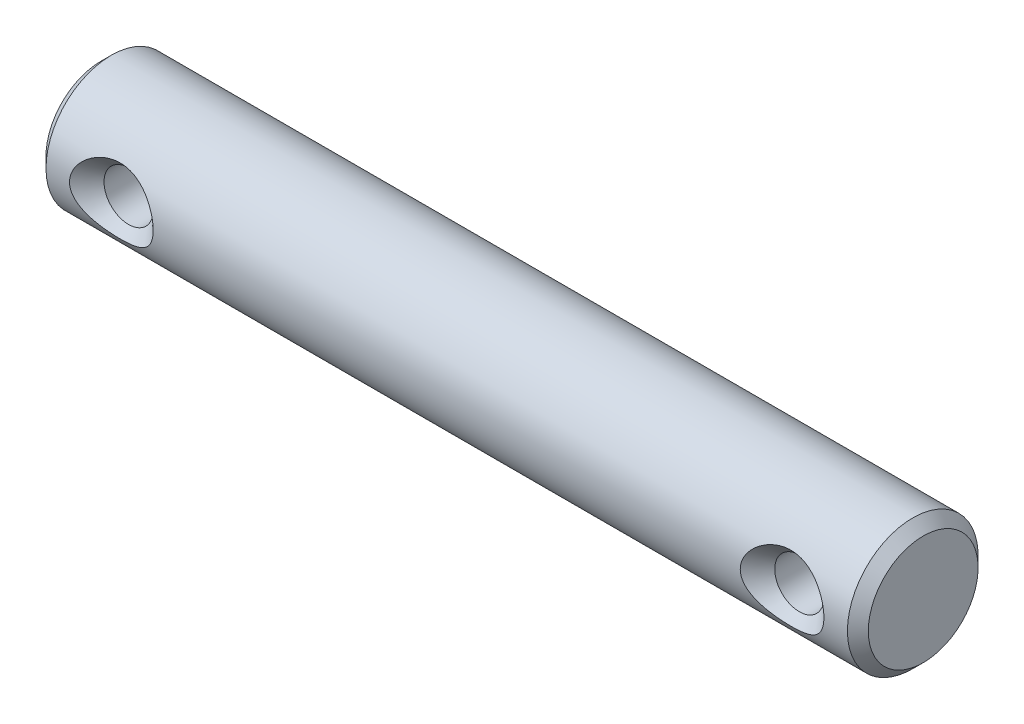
ISO-10303-21;
HEADER;
FILE_DESCRIPTION(('STEP AP214'),'2;1');
FILE_NAME('part.step','',(''),(''),'','','');
FILE_SCHEMA(('AUTOMOTIVE_DESIGN { 1 0 10303 214 1 1 1 1 }'));
ENDSEC;
DATA;
#1=APPLICATION_CONTEXT('core data for automotive mechanical design processes');
#2=APPLICATION_PROTOCOL_DEFINITION('international standard','automotive_design',2000,#1);
#3=PRODUCT_CONTEXT('',#1,'mechanical');
#4=PRODUCT('Part','Part','',(#3));
#5=PRODUCT_RELATED_PRODUCT_CATEGORY('part','',(#4));
#6=PRODUCT_DEFINITION_FORMATION('','',#4);
#7=PRODUCT_DEFINITION_CONTEXT('part definition',#1,'design');
#8=PRODUCT_DEFINITION('design','',#6,#7);
#9=PRODUCT_DEFINITION_SHAPE('','',#8);
#10=(LENGTH_UNIT() NAMED_UNIT(*) SI_UNIT(.MILLI.,.METRE.));
#11=(NAMED_UNIT(*) PLANE_ANGLE_UNIT() SI_UNIT($,.RADIAN.));
#12=(NAMED_UNIT(*) SI_UNIT($,.STERADIAN.) SOLID_ANGLE_UNIT());
#13=UNCERTAINTY_MEASURE_WITH_UNIT(LENGTH_MEASURE(1.E-05),#10,'distance_accuracy_value','');
#14=(GEOMETRIC_REPRESENTATION_CONTEXT(3) GLOBAL_UNCERTAINTY_ASSIGNED_CONTEXT((#13)) GLOBAL_UNIT_ASSIGNED_CONTEXT((#10,
#11,#12)) REPRESENTATION_CONTEXT('',''));
#15=CARTESIAN_POINT('',(0.,0.,0.));
#16=DIRECTION('',(0.,0.,1.));
#17=DIRECTION('',(1.,0.,0.));
#18=AXIS2_PLACEMENT_3D('',#15,#16,#17);
#19=CARTESIAN_POINT('',(14.5542,-2.667,2.72034000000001));
#20=DIRECTION('',(1.,0.,0.));
#21=DIRECTION('',(0.,0.,-1.));
#22=AXIS2_PLACEMENT_3D('',#19,#20,#21);
#23=PLANE('',#22);
#24=CARTESIAN_POINT('',(14.5542,0.,0.));
#25=DIRECTION('',(-1.,0.,0.));
#26=DIRECTION('',(0.,0.,1.));
#27=AXIS2_PLACEMENT_3D('',#24,#25,#26);
#28=CIRCLE('',#27,2.667);
#29=CARTESIAN_POINT('',(14.5542,0.,2.667));
#30=VERTEX_POINT('',#29);
#31=EDGE_CURVE('E35',#30,#30,#28,.T.);
#32=ORIENTED_EDGE('',*,*,#31,.F.);
#33=EDGE_LOOP('',(#32));
#34=FACE_BOUND('',#33,.T.);
#35=ADVANCED_FACE('F30',(#34),#23,.T.);
#36=CARTESIAN_POINT('',(-25.4,-2.66700000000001,-2.72033999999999));
#37=DIRECTION('',(-1.,0.,0.));
#38=DIRECTION('',(0.,0.,1.));
#39=AXIS2_PLACEMENT_3D('',#36,#37,#38);
#40=PLANE('',#39);
#41=CARTESIAN_POINT('',(-25.4,0.,0.));
#42=DIRECTION('',(1.,0.,0.));
#43=DIRECTION('',(0.,1.,0.));
#44=AXIS2_PLACEMENT_3D('',#41,#42,#43);
#45=CIRCLE('',#44,2.667);
#46=CARTESIAN_POINT('',(-25.4,2.667,0.));
#47=VERTEX_POINT('',#46);
#48=EDGE_CURVE('E57',#47,#47,#45,.T.);
#49=ORIENTED_EDGE('',*,*,#48,.F.);
#50=EDGE_LOOP('',(#49));
#51=FACE_BOUND('',#50,.T.);
#52=ADVANCED_FACE('F91',(#51),#40,.T.);
#53=CARTESIAN_POINT('',(-21.717,0.,2.3368));
#54=DIRECTION('',(0.,0.,1.));
#55=DIRECTION('',(1.,0.,0.));
#56=AXIS2_PLACEMENT_3D('',#53,#54,#55);
#57=CONICAL_SURFACE('',#56,1.19380000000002,0.78539816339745);
#58=CARTESIAN_POINT('',(-21.717,0.,2.3368));
#59=DIRECTION('',(0.,0.,1.));
#60=DIRECTION('',(1.,0.,0.));
#61=AXIS2_PLACEMENT_3D('',#58,#59,#60);
#62=CIRCLE('',#61,1.19380000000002);
#63=CARTESIAN_POINT('',(-20.5232,0.,2.3368));
#64=VERTEX_POINT('',#63);
#65=EDGE_CURVE('E55',#64,#64,#62,.T.);
#66=ORIENTED_EDGE('',*,*,#65,.F.);
#67=EDGE_LOOP('',(#66));
#68=FACE_BOUND('',#67,.T.);
#69=CARTESIAN_POINT('',(-23.749,0.,3.17499999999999));
#70=CARTESIAN_POINT('',(-23.7490015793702,-0.069534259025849,3.17500076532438));
#71=CARTESIAN_POINT('',(-23.7431066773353,-0.139062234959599,3.17269326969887));
#72=CARTESIAN_POINT('',(-23.7200005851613,-0.275943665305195,3.16373080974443));
#73=CARTESIAN_POINT('',(-23.7027806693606,-0.34329540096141,3.15707249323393));
#74=CARTESIAN_POINT('',(-23.6583668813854,-0.47367804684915,3.14015343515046));
#75=CARTESIAN_POINT('',(-23.631225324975,-0.536729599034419,3.12991160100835));
#76=CARTESIAN_POINT('',(-23.5684843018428,-0.657809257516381,3.1067202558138));
#77=CARTESIAN_POINT('',(-23.5328940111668,-0.715842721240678,3.09377368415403));
#78=CARTESIAN_POINT('',(-23.4746909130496,-0.798182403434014,3.0731597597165));
#79=CARTESIAN_POINT('',(-23.454720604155,-0.824590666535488,3.06616876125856));
#80=CARTESIAN_POINT('',(-23.375823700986,-0.922539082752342,3.03894032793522));
#81=CARTESIAN_POINT('',(-23.3115905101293,-0.989585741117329,3.01755028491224));
#82=CARTESIAN_POINT('',(-23.1737834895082,-1.11317376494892,2.97418590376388));
#83=CARTESIAN_POINT('',(-23.1001877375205,-1.16968968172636,2.95221029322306));
#84=CARTESIAN_POINT('',(-22.9719311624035,-1.25489334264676,2.91671264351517));
#85=CARTESIAN_POINT('',(-22.9192918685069,-1.28652579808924,2.90284671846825));
#86=CARTESIAN_POINT('',(-22.8113504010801,-1.34523649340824,2.87610883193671));
#87=CARTESIAN_POINT('',(-22.756049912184,-1.37231756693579,2.86323625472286));
#88=CARTESIAN_POINT('',(-22.5856781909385,-1.4472443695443,2.82652533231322));
#89=CARTESIAN_POINT('',(-22.4670097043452,-1.4882027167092,2.80484671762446));
#90=CARTESIAN_POINT('',(-22.2234022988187,-1.55153991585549,2.77031828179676));
#91=CARTESIAN_POINT('',(-22.0984528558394,-1.57388640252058,2.75748384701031));
#92=CARTESIAN_POINT('',(-21.8465418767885,-1.59945402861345,2.7427352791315));
#93=CARTESIAN_POINT('',(-21.719592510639,-1.60276428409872,2.74077026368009));
#94=CARTESIAN_POINT('',(-21.4671146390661,-1.59040531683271,2.74796072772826));
#95=CARTESIAN_POINT('',(-21.3415842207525,-1.57476579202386,2.75709880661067));
#96=CARTESIAN_POINT('',(-21.1358617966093,-1.53309932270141,2.78039060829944));
#97=CARTESIAN_POINT('',(-21.0542901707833,-1.51215437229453,2.79192016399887));
#98=CARTESIAN_POINT('',(-20.8942291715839,-1.4619552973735,2.81853183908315));
#99=CARTESIAN_POINT('',(-20.8157436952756,-1.43269102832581,2.83361829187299));
#100=CARTESIAN_POINT('',(-20.6292008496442,-1.35118727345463,2.87364039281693));
#101=CARTESIAN_POINT('',(-20.5233540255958,-1.29450619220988,2.89998656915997));
#102=CARTESIAN_POINT('',(-20.3236711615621,-1.16392124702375,2.95480929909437));
#103=CARTESIAN_POINT('',(-20.2298012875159,-1.0900676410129,2.98327947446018));
#104=CARTESIAN_POINT('',(-20.1186561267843,-0.982990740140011,3.01910959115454));
#105=CARTESIAN_POINT('',(-20.0938731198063,-0.957642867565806,3.02725793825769));
#106=CARTESIAN_POINT('',(-20.0458915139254,-0.905383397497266,3.04329666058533));
#107=CARTESIAN_POINT('',(-20.0226938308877,-0.878470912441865,3.05118688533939));
#108=CARTESIAN_POINT('',(-19.9512023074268,-0.789772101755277,3.07585625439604));
#109=CARTESIAN_POINT('',(-19.9062814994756,-0.724972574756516,3.0919126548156));
#110=CARTESIAN_POINT('',(-19.8271540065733,-0.588351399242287,3.12079047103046));
#111=CARTESIAN_POINT('',(-19.7929522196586,-0.516526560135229,3.13361040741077));
#112=CARTESIAN_POINT('',(-19.7392936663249,-0.371692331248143,3.15396370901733));
#113=CARTESIAN_POINT('',(-19.719084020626,-0.299004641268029,3.16176505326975));
#114=CARTESIAN_POINT('',(-19.6919478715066,-0.150870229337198,3.17227888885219));
#115=CARTESIAN_POINT('',(-19.6850035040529,-0.0754273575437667,3.17499822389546));
#116=CARTESIAN_POINT('',(-19.684996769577,0.0695372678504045,3.17500163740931));
#117=CARTESIAN_POINT('',(-19.6908927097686,0.139061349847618,3.17269357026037));
#118=CARTESIAN_POINT('',(-19.7139993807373,0.275940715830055,3.16373076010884));
#119=CARTESIAN_POINT('',(-19.731219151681,0.343294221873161,3.15707254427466));
#120=CARTESIAN_POINT('',(-19.775633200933,0.473678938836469,3.14015342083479));
#121=CARTESIAN_POINT('',(-19.8027751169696,0.536730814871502,3.12991143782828));
#122=CARTESIAN_POINT('',(-19.8655164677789,0.657810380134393,3.1067199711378));
#123=CARTESIAN_POINT('',(-19.9011065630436,0.715843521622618,3.09377347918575));
#124=CARTESIAN_POINT('',(-19.9590282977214,0.797785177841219,3.07325920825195));
#125=CARTESIAN_POINT('',(-19.9786934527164,0.823815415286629,3.06637390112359));
#126=CARTESIAN_POINT('',(-20.05721158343,0.921473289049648,3.03926521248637));
#127=CARTESIAN_POINT('',(-20.1214039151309,0.988588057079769,3.01787861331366));
#128=CARTESIAN_POINT('',(-20.2591439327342,1.11230673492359,2.97451165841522));
#129=CARTESIAN_POINT('',(-20.3327135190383,1.16888525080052,2.9525300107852));
#130=CARTESIAN_POINT('',(-20.4606192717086,1.25397837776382,2.91710375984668));
#131=CARTESIAN_POINT('',(-20.51291151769,1.28546745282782,2.90331405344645));
#132=CARTESIAN_POINT('',(-20.6201341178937,1.34394625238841,2.87671047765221));
#133=CARTESIAN_POINT('',(-20.6750628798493,1.37093864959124,2.86389603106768));
#134=CARTESIAN_POINT('',(-20.8449813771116,1.44598740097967,2.82717234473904));
#135=CARTESIAN_POINT('',(-20.9635964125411,1.48712709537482,2.8054198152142));
#136=CARTESIAN_POINT('',(-21.2071033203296,1.55081946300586,2.77072408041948));
#137=CARTESIAN_POINT('',(-21.3320046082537,1.57334331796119,2.75779453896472));
#138=CARTESIAN_POINT('',(-21.5838242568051,1.59926255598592,2.74284832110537));
#139=CARTESIAN_POINT('',(-21.7107293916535,1.60275312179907,2.74077734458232));
#140=CARTESIAN_POINT('',(-21.9632422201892,1.59076921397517,2.74774842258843));
#141=CARTESIAN_POINT('',(-22.0888506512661,1.57530619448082,2.75678376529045));
#142=CARTESIAN_POINT('',(-22.3323543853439,1.52634209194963,2.78417996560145));
#143=CARTESIAN_POINT('',(-22.4503607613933,1.49326521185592,2.80232096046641));
#144=CARTESIAN_POINT('',(-22.6789323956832,1.40959996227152,2.84532224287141));
#145=CARTESIAN_POINT('',(-22.7894846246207,1.35898183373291,2.87019393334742));
#146=CARTESIAN_POINT('',(-23.003066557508,1.23844305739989,2.92427659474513));
#147=CARTESIAN_POINT('',(-23.1057675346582,1.16798481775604,2.95359607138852));
#148=CARTESIAN_POINT('',(-23.2952388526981,1.00813226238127,3.01188921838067));
#149=CARTESIAN_POINT('',(-23.3820609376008,0.918801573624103,3.04086371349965));
#150=CARTESIAN_POINT('',(-23.5035326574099,0.760390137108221,3.0832225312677));
#151=CARTESIAN_POINT('',(-23.5452713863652,0.697164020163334,3.09825643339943));
#152=CARTESIAN_POINT('',(-23.6185593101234,0.564423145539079,3.1251588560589));
#153=CARTESIAN_POINT('',(-23.6501211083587,0.494916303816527,3.13703128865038));
#154=CARTESIAN_POINT('',(-23.6994017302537,0.355475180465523,3.1557706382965));
#155=CARTESIAN_POINT('',(-23.7178687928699,0.285845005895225,3.16290627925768));
#156=CARTESIAN_POINT('',(-23.7426629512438,0.144139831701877,3.17251896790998));
#157=CARTESIAN_POINT('',(-23.7489983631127,0.0720665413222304,3.17499920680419));
#158=CARTESIAN_POINT('',(-23.749,0.,3.17499999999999));
#159=B_SPLINE_CURVE_WITH_KNOTS('',3,(#69,#70,#71,#72,#73,#74,#75,#76,#77,#78,#79,#80,#81,#82,
#83,#84,#85,#86,#87,#88,#89,#90,#91,#92,#93,#94,#95,#96,#97,#98,#99,#100,#101,#102,#103,#104,
#105,#106,#107,#108,#109,#110,#111,#112,#113,#114,#115,#116,#117,#118,#119,#120,#121,#122,#123,
#124,#125,#126,#127,#128,#129,#130,#131,#132,#133,#134,#135,#136,#137,#138,#139,#140,#141,#142,
#143,#144,#145,#146,#147,#148,#149,#150,#151,#152,#153,#154,#155,#156,#157,#158),.UNSPECIFIED.,
.T.,.F.,(4,2,2,2,2,2,2,2,2,2,2,2,2,2,2,2,2,2,2,2,2,2,2,2,2,2,2,2,2,2,2,2,2,2,2,2,2,2,2,2,2,2,2,
2,4),(0.,0.208318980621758,0.41679865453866,0.624194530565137,0.831366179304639,
0.932844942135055,1.21732651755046,1.50248690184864,1.69113678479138,1.87966877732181,
2.25991242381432,2.64081592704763,3.01993481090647,3.39846031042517,3.65296959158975,
3.90779056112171,4.27490923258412,4.6409667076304,4.75003704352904,4.859169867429,
5.09956038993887,5.34006059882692,5.56632681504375,5.79228810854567,6.00060418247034,
6.20908676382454,6.4164846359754,6.62365428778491,6.72364453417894,7.00818115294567,
7.29339491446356,7.4809120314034,7.66831729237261,8.04862132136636,8.42951298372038,
8.80849810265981,9.18725430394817,9.55727593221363,9.9279284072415,10.3097933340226,
10.6903908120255,10.9212930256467,11.1519081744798,11.3679618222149,11.5838673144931),.UNSPECIFIED.);
#160=CARTESIAN_POINT('',(-23.749,0.,3.17499999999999));
#161=VERTEX_POINT('',#160);
#162=EDGE_CURVE('E51',#161,#161,#159,.T.);
#163=ORIENTED_EDGE('',*,*,#162,.T.);
#164=EDGE_LOOP('',(#163));
#165=FACE_BOUND('',#164,.T.);
#166=ADVANCED_FACE('F85',(#68,#165),#57,.F.);
#167=CARTESIAN_POINT('',(14.5542,0.,0.));
#168=DIRECTION('',(-1.,0.,0.));
#169=DIRECTION('',(0.,0.,1.));
#170=AXIS2_PLACEMENT_3D('',#167,#168,#169);
#171=CONICAL_SURFACE('',#170,2.667,0.785398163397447);
#172=CARTESIAN_POINT('',(14.0462,0.,0.));
#173=DIRECTION('',(-1.,0.,0.));
#174=DIRECTION('',(0.,0.,1.));
#175=AXIS2_PLACEMENT_3D('',#172,#173,#174);
#176=CIRCLE('',#175,3.175);
#177=CARTESIAN_POINT('',(14.0462,0.,3.175));
#178=VERTEX_POINT('',#177);
#179=EDGE_CURVE('E47',#178,#178,#176,.T.);
#180=ORIENTED_EDGE('',*,*,#179,.F.);
#181=EDGE_LOOP('',(#180));
#182=FACE_BOUND('',#181,.T.);
#183=ORIENTED_EDGE('',*,*,#31,.T.);
#184=EDGE_LOOP('',(#183));
#185=FACE_BOUND('',#184,.T.);
#186=ADVANCED_FACE('F90',(#182,#185),#171,.T.);
#187=CARTESIAN_POINT('',(-24.892,0.,0.));
#188=DIRECTION('',(1.,0.,0.));
#189=DIRECTION('',(0.,1.,0.));
#190=AXIS2_PLACEMENT_3D('',#187,#188,#189);
#191=CONICAL_SURFACE('',#190,3.175,0.78539816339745);
#192=ORIENTED_EDGE('',*,*,#48,.T.);
#193=EDGE_LOOP('',(#192));
#194=FACE_BOUND('',#193,.T.);
#195=CARTESIAN_POINT('',(-24.892,0.,0.));
#196=DIRECTION('',(1.,0.,0.));
#197=DIRECTION('',(0.,1.,0.));
#198=AXIS2_PLACEMENT_3D('',#195,#196,#197);
#199=CIRCLE('',#198,3.175);
#200=CARTESIAN_POINT('',(-24.892,3.17500000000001,0.));
#201=VERTEX_POINT('',#200);
#202=EDGE_CURVE('E50',#201,#201,#199,.T.);
#203=ORIENTED_EDGE('',*,*,#202,.F.);
#204=EDGE_LOOP('',(#203));
#205=FACE_BOUND('',#204,.T.);
#206=ADVANCED_FACE('F95',(#194,#205),#191,.T.);
#207=CARTESIAN_POINT('',(-21.717,0.,-3.17783227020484));
#208=DIRECTION('',(0.,0.,1.));
#209=DIRECTION('',(1.,0.,0.));
#210=AXIS2_PLACEMENT_3D('',#207,#208,#209);
#211=CYLINDRICAL_SURFACE('',#210,1.19380000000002);
#212=ORIENTED_EDGE('',*,*,#65,.T.);
#213=EDGE_LOOP('',(#212));
#214=FACE_BOUND('',#213,.T.);
#215=CARTESIAN_POINT('',(-22.9108,0.,-3.175));
#216=CARTESIAN_POINT('',(-22.9107980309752,-0.0646395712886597,-3.17499825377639));
#217=CARTESIAN_POINT('',(-22.9055305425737,-0.129305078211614,-3.17300734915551));
#218=CARTESIAN_POINT('',(-22.8846618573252,-0.256688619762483,-3.16525020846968));
#219=CARTESIAN_POINT('',(-22.869063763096,-0.319407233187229,-3.15948510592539));
#220=CARTESIAN_POINT('',(-22.8356793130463,-0.418772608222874,-3.14750197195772));
#221=CARTESIAN_POINT('',(-22.8207965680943,-0.456540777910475,-3.14222653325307));
#222=CARTESIAN_POINT('',(-22.7873447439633,-0.530243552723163,-3.13063219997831));
#223=CARTESIAN_POINT('',(-22.7687751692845,-0.566177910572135,-3.12431316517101));
#224=CARTESIAN_POINT('',(-22.7141070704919,-0.659990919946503,-3.10622496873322));
#225=CARTESIAN_POINT('',(-22.6747645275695,-0.715868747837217,-3.09370774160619));
#226=CARTESIAN_POINT('',(-22.5872866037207,-0.819990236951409,-3.06775614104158));
#227=CARTESIAN_POINT('',(-22.5391521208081,-0.868234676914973,-3.05432186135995));
#228=CARTESIAN_POINT('',(-22.4608319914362,-0.934383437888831,-3.03448483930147));
#229=CARTESIAN_POINT('',(-22.4334137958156,-0.955567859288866,-3.0278633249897));
#230=CARTESIAN_POINT('',(-22.3767925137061,-0.995506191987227,-3.01496796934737));
#231=CARTESIAN_POINT('',(-22.3475898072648,-1.01426061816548,-3.00869405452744));
#232=CARTESIAN_POINT('',(-22.2626724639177,-1.06368648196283,-2.9917120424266));
#233=CARTESIAN_POINT('',(-22.2050375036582,-1.09135814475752,-2.98163663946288));
#234=CARTESIAN_POINT('',(-22.0856417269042,-1.13725901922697,-2.96443479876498));
#235=CARTESIAN_POINT('',(-22.0238766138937,-1.15547821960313,-2.95731148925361));
#236=CARTESIAN_POINT('',(-21.8977819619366,-1.18179003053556,-2.94689693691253));
#237=CARTESIAN_POINT('',(-21.8334483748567,-1.18986594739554,-2.94361201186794));
#238=CARTESIAN_POINT('',(-21.7042410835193,-1.1954814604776,-2.9413363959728));
#239=CARTESIAN_POINT('',(-21.6393673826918,-1.19302112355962,-2.94234567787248));
#240=CARTESIAN_POINT('',(-21.5132181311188,-1.17793731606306,-2.9484145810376));
#241=CARTESIAN_POINT('',(-21.4518945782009,-1.16565324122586,-2.95333891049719));
#242=CARTESIAN_POINT('',(-21.3323288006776,-1.13182888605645,-2.96646479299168));
#243=CARTESIAN_POINT('',(-21.2740815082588,-1.11030439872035,-2.97466075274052));
#244=CARTESIAN_POINT('',(-21.1832914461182,-1.06854263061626,-2.9898373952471));
#245=CARTESIAN_POINT('',(-21.1493856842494,-1.05091932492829,-2.99609805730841));
#246=CARTESIAN_POINT('',(-21.0575598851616,-0.997461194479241,-3.01446715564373));
#247=CARTESIAN_POINT('',(-21.0017274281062,-0.958204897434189,-3.0273019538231));
#248=CARTESIAN_POINT('',(-20.8975882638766,-0.870832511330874,-3.05357973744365));
#249=CARTESIAN_POINT('',(-20.8492878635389,-0.822709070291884,-3.06702322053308));
#250=CARTESIAN_POINT('',(-20.7830436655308,-0.744368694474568,-3.0866302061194));
#251=CARTESIAN_POINT('',(-20.7618296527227,-0.716945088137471,-3.09313048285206));
#252=CARTESIAN_POINT('',(-20.7218293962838,-0.660299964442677,-3.10571586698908));
#253=CARTESIAN_POINT('',(-20.7030426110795,-0.631078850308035,-3.11180106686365));
#254=CARTESIAN_POINT('',(-20.6534378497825,-0.545944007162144,-3.12821178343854));
#255=CARTESIAN_POINT('',(-20.625647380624,-0.48808700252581,-3.13784288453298));
#256=CARTESIAN_POINT('',(-20.5796143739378,-0.368277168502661,-3.15414729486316));
#257=CARTESIAN_POINT('',(-20.5613724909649,-0.306324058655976,-3.16082040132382));
#258=CARTESIAN_POINT('',(-20.539931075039,-0.203302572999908,-3.1687383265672));
#259=CARTESIAN_POINT('',(-20.5336667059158,-0.162933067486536,-3.17107694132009));
#260=CARTESIAN_POINT('',(-20.5253004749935,-0.0817153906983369,-3.17420848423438));
#261=CARTESIAN_POINT('',(-20.5231976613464,-0.0408673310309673,-3.17500176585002));
#262=CARTESIAN_POINT('',(-20.5232036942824,0.0645565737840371,-3.17499721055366));
#263=CARTESIAN_POINT('',(-20.5284604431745,0.129161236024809,-3.17301051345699));
#264=CARTESIAN_POINT('',(-20.5492926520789,0.256499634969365,-3.16526730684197));
#265=CARTESIAN_POINT('',(-20.5648813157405,0.319230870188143,-3.1595059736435));
#266=CARTESIAN_POINT('',(-20.6057424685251,0.440875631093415,-3.14483682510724));
#267=CARTESIAN_POINT('',(-20.6309906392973,0.499798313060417,-3.1359369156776));
#268=CARTESIAN_POINT('',(-20.6903524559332,0.612548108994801,-3.11587765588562));
#269=CARTESIAN_POINT('',(-20.7244659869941,0.666375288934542,-3.10471833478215));
#270=CARTESIAN_POINT('',(-20.8021146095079,0.769727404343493,-3.08075765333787));
#271=CARTESIAN_POINT('',(-20.8459619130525,0.819006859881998,-3.06790960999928));
#272=CARTESIAN_POINT('',(-20.9411814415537,0.909720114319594,-3.0422461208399));
#273=CARTESIAN_POINT('',(-20.9925574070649,0.951149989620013,-3.02943069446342));
#274=CARTESIAN_POINT('',(-21.1037841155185,1.02655323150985,-3.00473805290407));
#275=CARTESIAN_POINT('',(-21.1638859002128,1.06017595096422,-2.99291634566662));
#276=CARTESIAN_POINT('',(-21.2893729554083,1.11669809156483,-2.97229273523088));
#277=CARTESIAN_POINT('',(-21.3547512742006,1.13961136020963,-2.96348693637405));
#278=CARTESIAN_POINT('',(-21.4698283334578,1.16898582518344,-2.95199357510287));
#279=CARTESIAN_POINT('',(-21.518721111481,1.17826902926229,-2.94827941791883));
#280=CARTESIAN_POINT('',(-21.6174035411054,1.19067673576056,-2.94329048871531));
#281=CARTESIAN_POINT('',(-21.6671930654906,1.19380210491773,-2.94201537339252));
#282=CARTESIAN_POINT('',(-21.7814012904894,1.1937972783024,-2.94202008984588));
#283=CARTESIAN_POINT('',(-21.845831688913,1.18856574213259,-2.94415804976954));
#284=CARTESIAN_POINT('',(-21.972785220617,1.16785179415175,-2.95243387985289));
#285=CARTESIAN_POINT('',(-22.0353066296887,1.15236038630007,-2.95857526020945));
#286=CARTESIAN_POINT('',(-22.1565175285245,1.11178102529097,-2.97406021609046));
#287=CARTESIAN_POINT('',(-22.2152171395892,1.08671973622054,-2.98339488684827));
#288=CARTESIAN_POINT('',(-22.3275896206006,1.02779707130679,-3.0042021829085));
#289=CARTESIAN_POINT('',(-22.3812618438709,0.993934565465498,-3.01567508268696));
#290=CARTESIAN_POINT('',(-22.4847521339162,0.916556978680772,-3.04010934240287));
#291=CARTESIAN_POINT('',(-22.5342842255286,0.87267318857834,-3.05311464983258));
#292=CARTESIAN_POINT('',(-22.6254964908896,0.777270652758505,-3.07878434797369));
#293=CARTESIAN_POINT('',(-22.6671735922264,0.72574893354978,-3.09144860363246));
#294=CARTESIAN_POINT('',(-22.7428757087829,0.614351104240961,-3.11553419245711));
#295=CARTESIAN_POINT('',(-22.7765858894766,0.554247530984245,-3.12689732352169));
#296=CARTESIAN_POINT('',(-22.8332682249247,0.428754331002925,-3.14655526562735));
#297=CARTESIAN_POINT('',(-22.8562538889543,0.363371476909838,-3.15485393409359));
#298=CARTESIAN_POINT('',(-22.8857940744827,0.248119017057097,-3.16566246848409));
#299=CARTESIAN_POINT('',(-22.8951487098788,0.199040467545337,-3.16914305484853));
#300=CARTESIAN_POINT('',(-22.907652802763,0.0999798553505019,-3.17381263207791));
#301=CARTESIAN_POINT('',(-22.9108015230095,0.0499976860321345,-3.17500135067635));
#302=CARTESIAN_POINT('',(-22.9108,0.,-3.175));
#303=B_SPLINE_CURVE_WITH_KNOTS('',3,(#215,#216,#217,#218,#219,#220,#221,#222,#223,#224,#225,
#226,#227,#228,#229,#230,#231,#232,#233,#234,#235,#236,#237,#238,#239,#240,#241,#242,#243,#244,
#245,#246,#247,#248,#249,#250,#251,#252,#253,#254,#255,#256,#257,#258,#259,#260,#261,#262,#263,
#264,#265,#266,#267,#268,#269,#270,#271,#272,#273,#274,#275,#276,#277,#278,#279,#280,#281,#282,
#283,#284,#285,#286,#287,#288,#289,#290,#291,#292,#293,#294,#295,#296,#297,#298,#299,#300,#301,
#302),.UNSPECIFIED.,.T.,.F.,(4,2,2,2,2,2,2,2,2,2,2,2,2,2,2,2,2,2,2,2,2,2,2,2,2,2,2,2,2,2,2,2,2,
2,2,2,2,2,2,2,2,2,2,4),(0.,0.193733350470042,0.387408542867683,0.510010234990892,
0.632628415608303,0.840003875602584,1.04735816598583,1.15307131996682,1.25876203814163,
1.45201614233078,1.64547451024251,1.83925085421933,2.03302596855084,2.22038148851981,
2.40741806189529,2.52344309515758,2.73072698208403,2.9381835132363,3.04389366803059,
3.14958019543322,3.3433778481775,3.53718878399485,3.65972033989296,3.78222386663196,
3.97573804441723,4.16950000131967,4.3627773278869,4.5560521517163,4.75676938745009,
4.95758668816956,5.16617620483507,5.3744952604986,5.5237897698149,5.67306326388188,
5.86607666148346,6.05925952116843,6.25190800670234,6.44458123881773,6.64600998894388,
6.84751736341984,7.05600030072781,7.26421990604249,7.41405179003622,7.56390147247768),.UNSPECIFIED.);
#304=CARTESIAN_POINT('',(-22.9108,0.,-3.175));
#305=VERTEX_POINT('',#304);
#306=EDGE_CURVE('E54',#305,#305,#303,.T.);
#307=ORIENTED_EDGE('',*,*,#306,.F.);
#308=EDGE_LOOP('',(#307));
#309=FACE_BOUND('',#308,.T.);
#310=ADVANCED_FACE('F70',(#214,#309),#211,.F.);
#311=CARTESIAN_POINT('',(14.0462,0.,0.));
#312=DIRECTION('',(-1.,0.,0.));
#313=DIRECTION('',(0.,0.,1.));
#314=AXIS2_PLACEMENT_3D('',#311,#312,#313);
#315=CYLINDRICAL_SURFACE('',#314,3.175);
#316=ORIENTED_EDGE('',*,*,#179,.T.);
#317=EDGE_LOOP('',(#316));
#318=FACE_BOUND('',#317,.T.);
#319=CARTESIAN_POINT('',(12.065,0.,-3.17500000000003));
#320=CARTESIAN_POINT('',(12.0649980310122,-0.0646395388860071,-3.17499825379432));
#321=CARTESIAN_POINT('',(12.0597305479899,-0.129305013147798,-3.17300735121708));
#322=CARTESIAN_POINT('',(12.0388618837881,-0.256688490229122,-3.16525021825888));
#323=CARTESIAN_POINT('',(12.0232638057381,-0.319407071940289,-3.15948512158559));
#324=CARTESIAN_POINT('',(11.9898797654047,-0.418771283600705,-3.14750213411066));
#325=CARTESIAN_POINT('',(11.9749975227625,-0.456538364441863,-3.14222687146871));
#326=CARTESIAN_POINT('',(11.9415469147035,-0.530239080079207,-3.13063294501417));
#327=CARTESIAN_POINT('',(11.9229780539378,-0.56617246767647,-3.12431414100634));
#328=CARTESIAN_POINT('',(11.8683111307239,-0.659984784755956,-3.10622627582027));
#329=CARTESIAN_POINT('',(11.8289689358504,-0.715862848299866,-3.093709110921));
#330=CARTESIAN_POINT('',(11.741491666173,-0.819984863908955,-3.06775758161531));
#331=CARTESIAN_POINT('',(11.6933574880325,-0.868229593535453,-3.05432331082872));
#332=CARTESIAN_POINT('',(11.6150365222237,-0.934379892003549,-3.03448594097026));
#333=CARTESIAN_POINT('',(11.5876171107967,-0.955565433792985,-3.02786409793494));
#334=CARTESIAN_POINT('',(11.5309932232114,-0.995505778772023,-3.01496811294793));
#335=CARTESIAN_POINT('',(11.5017891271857,-1.01426109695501,-3.00869389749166));
#336=CARTESIAN_POINT('',(11.4168702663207,-1.06368760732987,-2.99171163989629));
#337=CARTESIAN_POINT('',(11.3592352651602,-1.09135914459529,-2.98163627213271));
#338=CARTESIAN_POINT('',(11.2398394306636,-1.137259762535,-2.96443451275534));
#339=CARTESIAN_POINT('',(11.1780743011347,-1.15547883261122,-2.95731124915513));
#340=CARTESIAN_POINT('',(11.0519796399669,-1.18179038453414,-2.94689679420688));
#341=CARTESIAN_POINT('',(10.9876460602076,-1.18986617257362,-2.94361192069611));
#342=CARTESIAN_POINT('',(10.8584388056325,-1.19548143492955,-2.94133640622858));
#343=CARTESIAN_POINT('',(10.7935651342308,-1.19302097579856,-2.94234573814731));
#344=CARTESIAN_POINT('',(10.6674159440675,-1.17793693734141,-2.9484147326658));
#345=CARTESIAN_POINT('',(10.6060924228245,-1.16565275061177,-2.95333910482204));
#346=CARTESIAN_POINT('',(10.4865267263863,-1.1318281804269,-2.9664650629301));
#347=CARTESIAN_POINT('',(10.4282794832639,-1.1103035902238,-2.97466105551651));
#348=CARTESIAN_POINT('',(10.3374907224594,-1.06854222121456,-2.98983753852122));
#349=CARTESIAN_POINT('',(10.303586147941,-1.0509195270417,-2.99609798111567));
#350=CARTESIAN_POINT('',(10.2117614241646,-0.997462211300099,-3.01446681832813));
#351=CARTESIAN_POINT('',(10.1559289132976,-0.958206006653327,-3.02730160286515));
#352=CARTESIAN_POINT('',(10.0517896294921,-0.87083379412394,-3.05357936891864));
#353=CARTESIAN_POINT('',(10.0034891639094,-0.822710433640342,-3.06702284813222));
#354=CARTESIAN_POINT('',(9.93724404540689,-0.744369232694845,-3.08663008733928));
#355=CARTESIAN_POINT('',(9.91602927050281,-0.716944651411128,-3.09313060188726));
#356=CARTESIAN_POINT('',(9.87602768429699,-0.660297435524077,-3.10571640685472));
#357=CARTESIAN_POINT('',(9.85724033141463,-0.63107520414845,-3.11180178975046));
#358=CARTESIAN_POINT('',(9.80763535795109,-0.545939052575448,-3.1282126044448));
#359=CARTESIAN_POINT('',(9.77984513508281,-0.48808195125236,-3.13784365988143));
#360=CARTESIAN_POINT('',(9.7338126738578,-0.368271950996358,-3.15414791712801));
#361=CARTESIAN_POINT('',(9.71557108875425,-0.306318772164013,-3.160820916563));
#362=CARTESIAN_POINT('',(9.69413033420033,-0.203298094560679,-3.16873860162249));
#363=CARTESIAN_POINT('',(9.68786624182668,-0.162929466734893,-3.17107711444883));
#364=CARTESIAN_POINT('',(9.67950038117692,-0.0817135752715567,-3.1742085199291));
#365=CARTESIAN_POINT('',(9.67739766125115,-0.0408664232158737,-3.17500176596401));
#366=CARTESIAN_POINT('',(9.67740369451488,0.0645565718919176,-3.1749972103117));
#367=CARTESIAN_POINT('',(9.68266044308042,0.129161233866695,-3.17301051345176));
#368=CARTESIAN_POINT('',(9.70349265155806,0.256499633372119,-3.16526730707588));
#369=CARTESIAN_POINT('',(9.71908131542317,0.319230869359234,-3.15950597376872));
#370=CARTESIAN_POINT('',(9.75994246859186,0.440875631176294,-3.14483682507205));
#371=CARTESIAN_POINT('',(9.78519063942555,0.49979831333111,-3.13593691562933));
#372=CARTESIAN_POINT('',(9.84455245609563,0.612548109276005,-3.1158776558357));
#373=CARTESIAN_POINT('',(9.87866598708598,0.6663752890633,-3.10471833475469));
#374=CARTESIAN_POINT('',(9.95631460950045,0.769727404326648,-3.08075765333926));
#375=CARTESIAN_POINT('',(10.0001619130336,0.819006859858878,-3.0679096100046));
#376=CARTESIAN_POINT('',(10.0953814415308,0.909720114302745,-3.04224612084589));
#377=CARTESIAN_POINT('',(10.1467574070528,0.951149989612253,-3.02943069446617));
#378=CARTESIAN_POINT('',(10.2579841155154,1.02655323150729,-3.00473805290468));
#379=CARTESIAN_POINT('',(10.318085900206,1.0601759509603,-2.99291634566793));
#380=CARTESIAN_POINT('',(10.443572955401,1.1166980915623,-2.97229273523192));
#381=CARTESIAN_POINT('',(10.5089512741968,1.13961136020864,-2.96348693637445));
#382=CARTESIAN_POINT('',(10.6240283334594,1.16898582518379,-2.95199357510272));
#383=CARTESIAN_POINT('',(10.6729211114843,1.17826902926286,-2.9482794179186));
#384=CARTESIAN_POINT('',(10.7716035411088,1.19067673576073,-2.94329048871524));
#385=CARTESIAN_POINT('',(10.8213930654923,1.1938021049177,-2.94201537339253));
#386=CARTESIAN_POINT('',(10.9356012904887,1.19379727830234,-2.94202008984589));
#387=CARTESIAN_POINT('',(11.0000316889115,1.18856574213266,-2.94415804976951));
#388=CARTESIAN_POINT('',(11.1269852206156,1.16785179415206,-2.95243387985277));
#389=CARTESIAN_POINT('',(11.1895066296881,1.15236038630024,-2.95857526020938));
#390=CARTESIAN_POINT('',(11.3107175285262,1.11178102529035,-2.9740602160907));
#391=CARTESIAN_POINT('',(11.3694171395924,1.08671973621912,-2.9833948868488));
#392=CARTESIAN_POINT('',(11.4817896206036,1.02779707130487,-3.00420218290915));
#393=CARTESIAN_POINT('',(11.5354618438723,0.993934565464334,-3.01567508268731));
#394=CARTESIAN_POINT('',(11.6389521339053,0.916556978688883,-3.04010934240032));
#395=CARTESIAN_POINT('',(11.6884842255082,0.872673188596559,-3.05311464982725));
#396=CARTESIAN_POINT('',(11.7796964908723,0.777270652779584,-3.07878434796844));
#397=CARTESIAN_POINT('',(11.8213735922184,0.725748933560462,-3.09144860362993));
#398=CARTESIAN_POINT('',(11.8970757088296,0.614351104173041,-3.11553419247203));
#399=CARTESIAN_POINT('',(11.930785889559,0.554247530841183,-3.12689732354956));
#400=CARTESIAN_POINT('',(11.9874682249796,0.428754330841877,-3.14655526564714));
#401=CARTESIAN_POINT('',(12.0104538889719,0.363371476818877,-3.1548539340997));
#402=CARTESIAN_POINT('',(12.0399940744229,0.248119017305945,-3.16566246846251));
#403=CARTESIAN_POINT('',(12.0493487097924,0.199040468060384,-3.16914305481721));
#404=CARTESIAN_POINT('',(12.0618528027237,0.0999798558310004,-3.1738126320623));
#405=CARTESIAN_POINT('',(12.0650015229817,0.0499976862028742,-3.1750013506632));
#406=CARTESIAN_POINT('',(12.065,0.,-3.17500000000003));
#407=B_SPLINE_CURVE_WITH_KNOTS('',3,(#319,#320,#321,#322,#323,#324,#325,#326,#327,#328,#329,
#330,#331,#332,#333,#334,#335,#336,#337,#338,#339,#340,#341,#342,#343,#344,#345,#346,#347,#348,
#349,#350,#351,#352,#353,#354,#355,#356,#357,#358,#359,#360,#361,#362,#363,#364,#365,#366,#367,
#368,#369,#370,#371,#372,#373,#374,#375,#376,#377,#378,#379,#380,#381,#382,#383,#384,#385,#386,
#387,#388,#389,#390,#391,#392,#393,#394,#395,#396,#397,#398,#399,#400,#401,#402,#403,#404,#405,
#406),.UNSPECIFIED.,.T.,.F.,(4,2,2,2,2,2,2,2,2,2,2,2,2,2,2,2,2,2,2,2,2,2,2,2,2,2,2,2,2,2,2,2,2,
2,2,2,2,2,2,2,2,2,2,4),(0.,0.193733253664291,0.38740833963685,0.510006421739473,
0.632620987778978,0.839996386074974,1.0473506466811,1.15306882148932,1.25876455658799,
1.45201859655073,1.64547688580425,1.83925315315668,2.03302819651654,2.2203837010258,
2.40742025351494,2.52344124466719,2.73072509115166,2.93818159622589,3.04389551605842,
3.14958580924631,3.34338339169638,3.53719423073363,3.6597230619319,3.78222386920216,
3.975738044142,4.16950000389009,4.36277733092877,4.55605215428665,4.75676938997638,
4.9575866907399,5.16617620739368,5.37449526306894,5.5237897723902,5.67306326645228,
5.86607666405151,6.05925952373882,6.25190800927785,6.44458124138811,6.64600999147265,
6.84751736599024,7.0560003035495,7.26421990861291,7.41405179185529,7.56390147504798),.UNSPECIFIED.);
#408=CARTESIAN_POINT('',(12.065,0.,-3.17500000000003));
#409=VERTEX_POINT('',#408);
#410=EDGE_CURVE('E39',#409,#409,#407,.T.);
#411=ORIENTED_EDGE('',*,*,#410,.F.);
#412=EDGE_LOOP('',(#411));
#413=FACE_BOUND('',#412,.T.);
#414=ORIENTED_EDGE('',*,*,#306,.T.);
#415=EDGE_LOOP('',(#414));
#416=FACE_BOUND('',#415,.T.);
#417=ORIENTED_EDGE('',*,*,#202,.T.);
#418=EDGE_LOOP('',(#417));
#419=FACE_BOUND('',#418,.T.);
#420=ORIENTED_EDGE('',*,*,#162,.F.);
#421=EDGE_LOOP('',(#420));
#422=FACE_BOUND('',#421,.T.);
#423=CARTESIAN_POINT('',(8.83920000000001,0.,3.17499999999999));
#424=CARTESIAN_POINT('',(8.83919888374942,-0.069546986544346,3.17500055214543));
#425=CARTESIAN_POINT('',(8.84509618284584,-0.139089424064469,3.17269216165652));
#426=CARTESIAN_POINT('',(8.86820547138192,-0.275969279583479,3.16372845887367));
#427=CARTESIAN_POINT('',(8.88542183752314,-0.343305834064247,3.15707146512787));
#428=CARTESIAN_POINT('',(8.92981597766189,-0.473624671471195,3.14016003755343));
#429=CARTESIAN_POINT('',(8.95693482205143,-0.536630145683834,3.12992690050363));
#430=CARTESIAN_POINT('',(9.01964812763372,-0.657701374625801,3.10674466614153));
#431=CARTESIAN_POINT('',(9.05524788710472,-0.7157640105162,3.09379387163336));
#432=CARTESIAN_POINT('',(9.15095556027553,-0.851152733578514,3.05989782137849));
#433=CARTESIAN_POINT('',(9.21491130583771,-0.925514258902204,3.03796386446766));
#434=CARTESIAN_POINT('',(9.35396941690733,-1.06249178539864,2.99281817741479));
#435=CARTESIAN_POINT('',(9.42909110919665,-1.12508698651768,2.96960427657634));
#436=CARTESIAN_POINT('',(9.58948297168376,-1.23979738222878,2.92359717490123));
#437=CARTESIAN_POINT('',(9.67492911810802,-1.29167234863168,2.9008222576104));
#438=CARTESIAN_POINT('',(9.85263430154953,-1.38345377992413,2.85818809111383));
#439=CARTESIAN_POINT('',(9.94489254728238,-1.42336163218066,2.8383285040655));
#440=CARTESIAN_POINT('',(10.1548308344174,-1.4984615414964,2.79953658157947));
#441=CARTESIAN_POINT('',(10.2737382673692,-1.53083576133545,2.78170396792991));
#442=CARTESIAN_POINT('',(10.5160508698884,-1.57761955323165,2.75544381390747));
#443=CARTESIAN_POINT('',(10.6394561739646,-1.59202858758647,2.74701655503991));
#444=CARTESIAN_POINT('',(10.8887532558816,-1.6026514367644,2.74083545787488));
#445=CARTESIAN_POINT('',(11.0146573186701,-1.59865467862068,2.74320513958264));
#446=CARTESIAN_POINT('',(11.2638604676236,-1.57206858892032,2.75852312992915));
#447=CARTESIAN_POINT('',(11.3871584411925,-1.54947147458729,2.77147586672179));
#448=CARTESIAN_POINT('',(11.6263172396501,-1.48643486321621,2.80577911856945));
#449=CARTESIAN_POINT('',(11.7422465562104,-1.44620064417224,2.82703271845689));
#450=CARTESIAN_POINT('',(11.9652373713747,-1.34813710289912,2.87508763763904));
#451=CARTESIAN_POINT('',(12.0722989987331,-1.29030803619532,2.90188887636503));
#452=CARTESIAN_POINT('',(12.2564232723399,-1.1686116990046,2.95271409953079));
#453=CARTESIAN_POINT('',(12.335454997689,-1.10757907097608,2.97640157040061));
#454=CARTESIAN_POINT('',(12.4825677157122,-0.973241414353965,3.02298891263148));
#455=CARTESIAN_POINT('',(12.550666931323,-0.899957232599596,3.04589004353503));
#456=CARTESIAN_POINT('',(12.6578687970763,-0.760256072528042,3.08326790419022));
#457=CARTESIAN_POINT('',(12.700013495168,-0.696369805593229,3.09845118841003));
#458=CARTESIAN_POINT('',(12.7738938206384,-0.562177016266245,3.12557965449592));
#459=CARTESIAN_POINT('',(12.8056402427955,-0.491877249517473,3.13752819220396));
#460=CARTESIAN_POINT('',(12.8545307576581,-0.352173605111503,3.15612851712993));
#461=CARTESIAN_POINT('',(12.8726539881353,-0.283163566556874,3.16313259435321));
#462=CARTESIAN_POINT('',(12.8969841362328,-0.142766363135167,3.17256655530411));
#463=CARTESIAN_POINT('',(12.9031988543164,-0.0713807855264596,3.17499943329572));
#464=CARTESIAN_POINT('',(12.9032011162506,0.0695469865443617,3.17500055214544));
#465=CARTESIAN_POINT('',(12.8973038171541,0.139089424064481,3.17269216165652));
#466=CARTESIAN_POINT('',(12.874194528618,0.275969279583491,3.16372845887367));
#467=CARTESIAN_POINT('',(12.8569781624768,0.343305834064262,3.15707146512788));
#468=CARTESIAN_POINT('',(12.8125840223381,0.473624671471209,3.14016003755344));
#469=CARTESIAN_POINT('',(12.7854651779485,0.536630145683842,3.12992690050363));
#470=CARTESIAN_POINT('',(12.7227518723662,0.657701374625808,3.10674466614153));
#471=CARTESIAN_POINT('',(12.6871521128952,0.715764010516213,3.09379387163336));
#472=CARTESIAN_POINT('',(12.5914444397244,0.85115273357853,3.0598978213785));
#473=CARTESIAN_POINT('',(12.5274886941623,0.925514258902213,3.03796386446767));
#474=CARTESIAN_POINT('',(12.3884305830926,1.06249178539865,2.99281817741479));
#475=CARTESIAN_POINT('',(12.3133088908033,1.12508698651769,2.96960427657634));
#476=CARTESIAN_POINT('',(12.1529170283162,1.23979738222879,2.92359717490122));
#477=CARTESIAN_POINT('',(12.0674708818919,1.29167234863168,2.9008222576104));
#478=CARTESIAN_POINT('',(11.8897656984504,1.38345377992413,2.85818809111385));
#479=CARTESIAN_POINT('',(11.7975074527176,1.42336163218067,2.83832850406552));
#480=CARTESIAN_POINT('',(11.5875691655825,1.49846154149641,2.79953658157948));
#481=CARTESIAN_POINT('',(11.4686617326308,1.53083576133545,2.78170396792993));
#482=CARTESIAN_POINT('',(11.2263491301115,1.57761955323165,2.75544381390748));
#483=CARTESIAN_POINT('',(11.1029438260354,1.59202858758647,2.74701655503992));
#484=CARTESIAN_POINT('',(10.8536467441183,1.6026514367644,2.74083545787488));
#485=CARTESIAN_POINT('',(10.7277426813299,1.59865467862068,2.74320513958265));
#486=CARTESIAN_POINT('',(10.4785395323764,1.57206858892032,2.75852312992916));
#487=CARTESIAN_POINT('',(10.3552415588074,1.54947147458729,2.77147586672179));
#488=CARTESIAN_POINT('',(10.1160827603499,1.48643486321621,2.80577911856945));
#489=CARTESIAN_POINT('',(10.0001534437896,1.44620064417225,2.8270327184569));
#490=CARTESIAN_POINT('',(9.77716262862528,1.34813710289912,2.87508763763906));
#491=CARTESIAN_POINT('',(9.67010100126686,1.29030803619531,2.90188887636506));
#492=CARTESIAN_POINT('',(9.48597672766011,1.16861169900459,2.95271409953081));
#493=CARTESIAN_POINT('',(9.40694500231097,1.10757907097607,2.97640157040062));
#494=CARTESIAN_POINT('',(9.25983228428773,0.973241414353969,3.02298891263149));
#495=CARTESIAN_POINT('',(9.19173306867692,0.899957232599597,3.04589004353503));
#496=CARTESIAN_POINT('',(9.08453120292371,0.760256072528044,3.08326790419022));
#497=CARTESIAN_POINT('',(9.04238650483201,0.696369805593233,3.09845118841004));
#498=CARTESIAN_POINT('',(8.96850617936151,0.562177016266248,3.12557965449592));
#499=CARTESIAN_POINT('',(8.93675975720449,0.491877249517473,3.13752819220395));
#500=CARTESIAN_POINT('',(8.88786924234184,0.352173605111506,3.15612851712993));
#501=CARTESIAN_POINT('',(8.86974601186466,0.283163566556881,3.16313259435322));
#502=CARTESIAN_POINT('',(8.84541586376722,0.142766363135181,3.17256655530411));
#503=CARTESIAN_POINT('',(8.83920114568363,0.0713807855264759,3.17499943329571));
#504=CARTESIAN_POINT('',(8.83920000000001,0.,3.17499999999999));
#505=B_SPLINE_CURVE_WITH_KNOTS('',3,(#423,#424,#425,#426,#427,#428,#429,#430,#431,#432,#433,
#434,#435,#436,#437,#438,#439,#440,#441,#442,#443,#444,#445,#446,#447,#448,#449,#450,#451,#452,
#453,#454,#455,#456,#457,#458,#459,#460,#461,#462,#463,#464,#465,#466,#467,#468,#469,#470,#471,
#472,#473,#474,#475,#476,#477,#478,#479,#480,#481,#482,#483,#484,#485,#486,#487,#488,#489,#490,
#491,#492,#493,#494,#495,#496,#497,#498,#499,#500,#501,#502,#503,#504),.UNSPECIFIED.,.T.,.F.,(4,
2,2,2,2,2,2,2,2,2,2,2,2,2,2,2,2,2,2,2,2,2,2,2,2,2,2,2,2,2,2,2,2,2,2,2,2,2,2,2,4),(0.,
0.208359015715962,0.416798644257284,0.624017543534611,0.831366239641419,1.13123370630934,
1.43162638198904,1.73815597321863,2.04465001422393,2.41646670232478,2.78829451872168,
3.16438676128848,3.54063644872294,3.91261865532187,4.2845954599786,4.5913781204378,
4.89764398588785,5.13086576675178,5.36384465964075,5.57783785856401,5.79169083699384,
6.0000498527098,6.20848948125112,6.41570838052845,6.62305707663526,6.92292454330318,
7.22331721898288,7.52984681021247,7.83634085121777,8.20815753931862,8.57998535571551,
8.95607759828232,9.33232728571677,9.7043094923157,10.0762862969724,10.3830689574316,
10.6893348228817,10.9225566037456,11.1555354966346,11.3695286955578,11.5833816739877),.UNSPECIFIED.);
#506=CARTESIAN_POINT('',(8.83920000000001,0.,3.17499999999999));
#507=VERTEX_POINT('',#506);
#508=EDGE_CURVE('E44',#507,#507,#505,.T.);
#509=ORIENTED_EDGE('',*,*,#508,.F.);
#510=EDGE_LOOP('',(#509));
#511=FACE_BOUND('',#510,.T.);
#512=ADVANCED_FACE('F65',(#318,#413,#416,#419,#422,#511),#315,.T.);
#513=CARTESIAN_POINT('',(10.8712,0.,2.3368));
#514=DIRECTION('',(0.,0.,1.));
#515=DIRECTION('',(1.,0.,0.));
#516=AXIS2_PLACEMENT_3D('',#513,#514,#515);
#517=CONICAL_SURFACE('',#516,1.19379999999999,0.785398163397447);
#518=CARTESIAN_POINT('',(10.8712,0.,2.3368));
#519=DIRECTION('',(0.,0.,1.));
#520=DIRECTION('',(1.,0.,0.));
#521=AXIS2_PLACEMENT_3D('',#518,#519,#520);
#522=CIRCLE('',#521,1.19379999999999);
#523=CARTESIAN_POINT('',(12.065,0.,2.3368));
#524=VERTEX_POINT('',#523);
#525=EDGE_CURVE('E10',#524,#524,#522,.T.);
#526=ORIENTED_EDGE('',*,*,#525,.F.);
#527=EDGE_LOOP('',(#526));
#528=FACE_BOUND('',#527,.T.);
#529=ORIENTED_EDGE('',*,*,#508,.T.);
#530=EDGE_LOOP('',(#529));
#531=FACE_BOUND('',#530,.T.);
#532=ADVANCED_FACE('F69',(#528,#531),#517,.F.);
#533=CARTESIAN_POINT('',(10.8712,0.,-3.17783227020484));
#534=DIRECTION('',(0.,0.,1.));
#535=DIRECTION('',(1.,0.,0.));
#536=AXIS2_PLACEMENT_3D('',#533,#534,#535);
#537=CYLINDRICAL_SURFACE('',#536,1.19379999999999);
#538=ORIENTED_EDGE('',*,*,#410,.T.);
#539=EDGE_LOOP('',(#538));
#540=FACE_BOUND('',#539,.T.);
#541=ORIENTED_EDGE('',*,*,#525,.T.);
#542=EDGE_LOOP('',(#541));
#543=FACE_BOUND('',#542,.T.);
#544=ADVANCED_FACE('F32',(#540,#543),#537,.F.);
#545=CLOSED_SHELL('',(#35,#52,#166,#186,#206,#310,#512,#532,#544));
#546=MANIFOLD_SOLID_BREP('B2',#545);
#547=ADVANCED_BREP_SHAPE_REPRESENTATION('',(#18,#546),#14);
#548=SHAPE_DEFINITION_REPRESENTATION(#9,#547);
ENDSEC;
END-ISO-10303-21;
